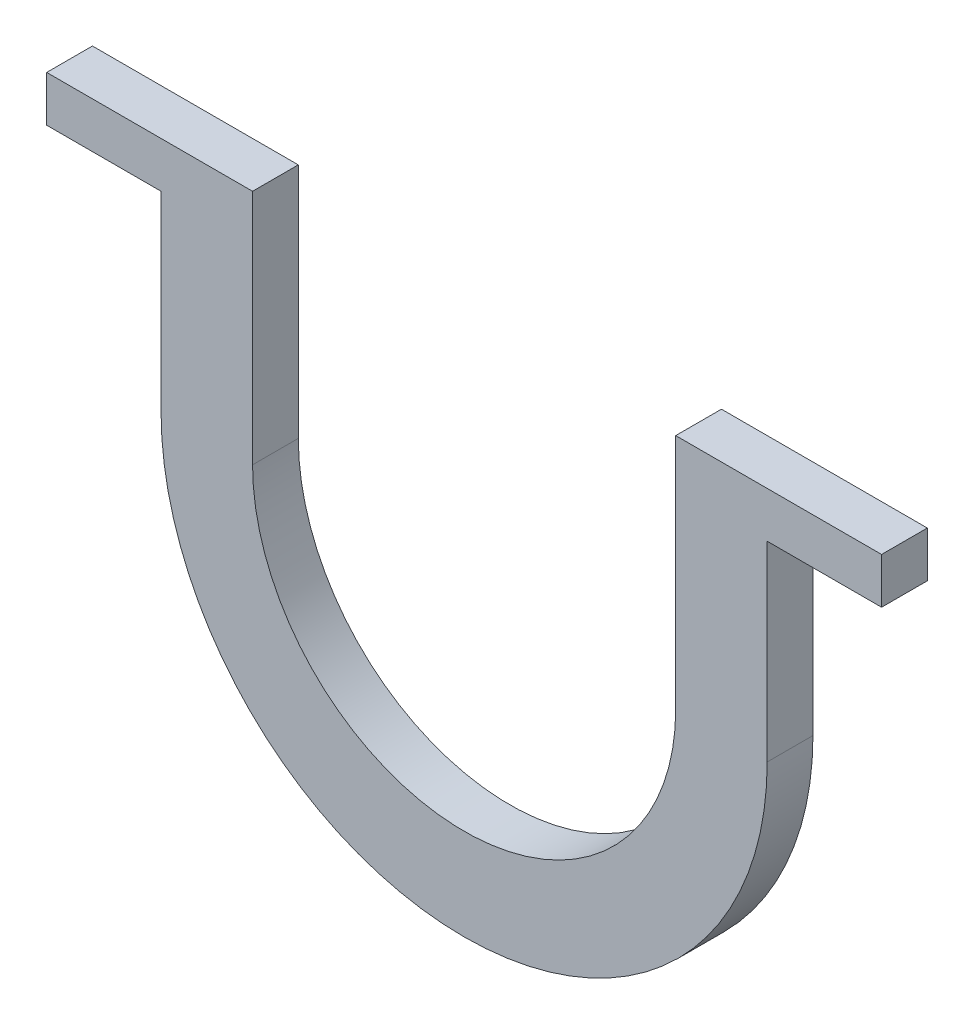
from build123d import *

# Parameters (mm, degrees)
BOSS_EXTRUDE1_DEPTH = 4
SKETCH3_W           = 4
SKETCH3_H           = 4
BOSS_EXTRUDE3_DEPTH = 10
SKETCH4_W           = 4
SKETCH4_H           = 4
BOSS_EXTRUDE4_DEPTH = 10


with BuildPart() as part:
    # Sketch1 → Boss-Extrude1 (new body)
    with BuildSketch(Plane.XY):
        with BuildLine():
            Line((-20.489268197, 1.593348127), (-20.489268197, 22.306873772))
            Line((-20.489268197, 22.306873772), (-28.489268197, 22.306873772))
            Line((-28.489268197, 22.306873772), (-28.489268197, 1.593348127))
            ThreePointArc((-28.489268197, 1.593348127), (-1.989268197, -24.906651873), (24.510731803, 1.593348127))
            Line((24.510731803, 1.593348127), (24.510731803, 22.306873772))
            Line((24.510731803, 22.306873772), (16.510731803, 22.306873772))
            Line((16.510731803, 22.306873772), (16.510731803, 1.593348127))
            ThreePointArc((16.510731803, 1.593348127), (-1.989268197, -16.906651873), (-20.489268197, 1.593348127))
        make_face()
    extrude(amount=BOSS_EXTRUDE1_DEPTH)

    # Sketch3 → Boss-Extrude3 (add)
    with BuildSketch(Plane(origin=(24.510731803, 0, 0), x_dir=(0, 0, -1), z_dir=(1, 0, 0))):
        with Locations((-2, 20.306873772)):
            Rectangle(SKETCH3_W, SKETCH3_H)
    extrude(amount=BOSS_EXTRUDE3_DEPTH)

    # Sketch4 → Boss-Extrude4 (add)
    with BuildSketch(Plane.ZY.offset(28.489268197)):
        with Locations((2, 20.306873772)):
            Rectangle(SKETCH4_W, SKETCH4_H)
    extrude(amount=BOSS_EXTRUDE4_DEPTH)


solid = part.part
